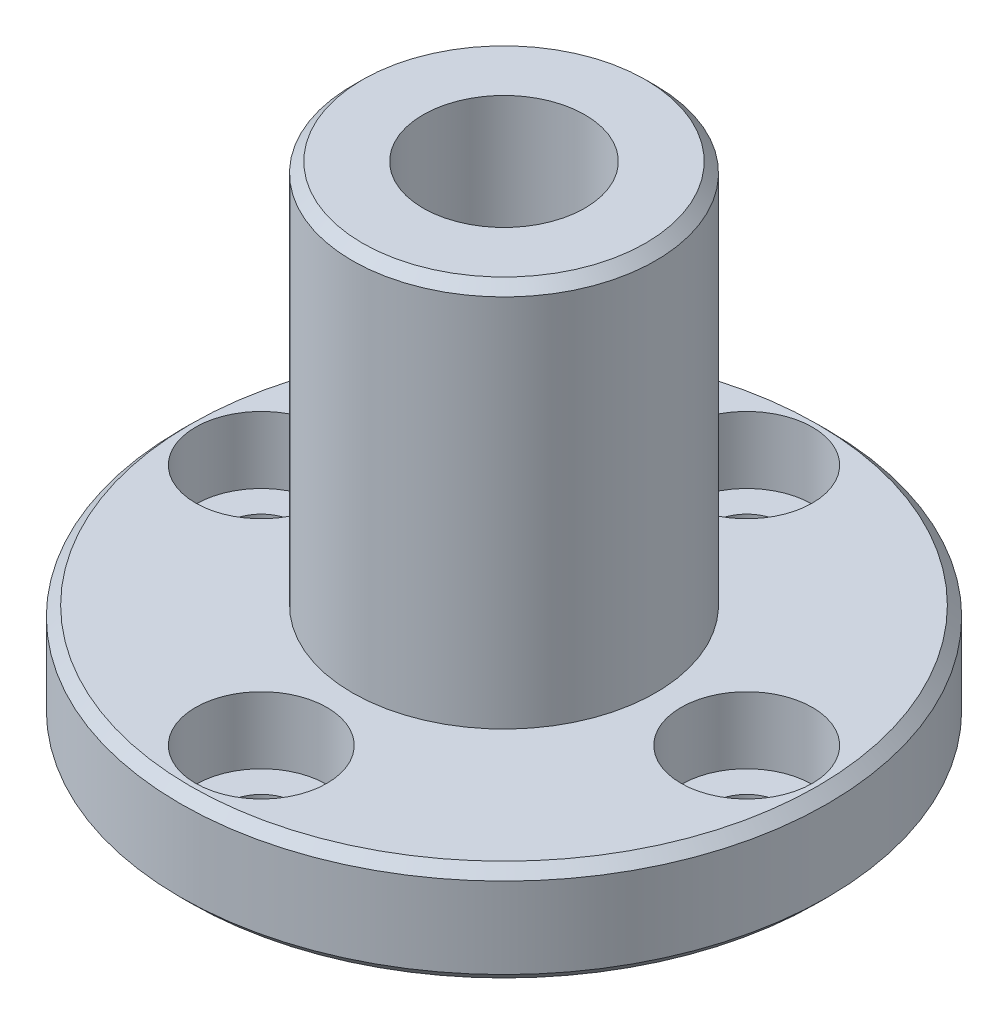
ISO-10303-21;
HEADER;
FILE_DESCRIPTION(('STEP AP214'),'2;1');
FILE_NAME('part.step','',(''),(''),'','','');
FILE_SCHEMA(('AUTOMOTIVE_DESIGN { 1 0 10303 214 1 1 1 1 }'));
ENDSEC;
DATA;
#1=APPLICATION_CONTEXT('core data for automotive mechanical design processes');
#2=APPLICATION_PROTOCOL_DEFINITION('international standard','automotive_design',2000,#1);
#3=PRODUCT_CONTEXT('',#1,'mechanical');
#4=PRODUCT('Part','Part','',(#3));
#5=PRODUCT_RELATED_PRODUCT_CATEGORY('part','',(#4));
#6=PRODUCT_DEFINITION_FORMATION('','',#4);
#7=PRODUCT_DEFINITION_CONTEXT('part definition',#1,'design');
#8=PRODUCT_DEFINITION('design','',#6,#7);
#9=PRODUCT_DEFINITION_SHAPE('','',#8);
#10=(LENGTH_UNIT() NAMED_UNIT(*) SI_UNIT(.MILLI.,.METRE.));
#11=(NAMED_UNIT(*) PLANE_ANGLE_UNIT() SI_UNIT($,.RADIAN.));
#12=(NAMED_UNIT(*) SI_UNIT($,.STERADIAN.) SOLID_ANGLE_UNIT());
#13=UNCERTAINTY_MEASURE_WITH_UNIT(LENGTH_MEASURE(1.E-05),#10,'distance_accuracy_value','');
#14=(GEOMETRIC_REPRESENTATION_CONTEXT(3) GLOBAL_UNCERTAINTY_ASSIGNED_CONTEXT((#13)) GLOBAL_UNIT_ASSIGNED_CONTEXT((#10,
#11,#12)) REPRESENTATION_CONTEXT('',''));
#15=CARTESIAN_POINT('',(0.,0.,0.));
#16=DIRECTION('',(0.,0.,1.));
#17=DIRECTION('',(1.,0.,0.));
#18=AXIS2_PLACEMENT_3D('',#15,#16,#17);
#19=CARTESIAN_POINT('',(0.,0.,0.));
#20=DIRECTION('',(0.,1.,0.));
#21=DIRECTION('',(0.,0.,1.));
#22=AXIS2_PLACEMENT_3D('',#19,#20,#21);
#23=CONICAL_SURFACE('',#22,15.5,0.785398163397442);
#24=CARTESIAN_POINT('',(0.,0.500000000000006,0.));
#25=DIRECTION('',(0.,1.,0.));
#26=DIRECTION('',(0.,0.,1.));
#27=AXIS2_PLACEMENT_3D('',#24,#25,#26);
#28=CIRCLE('',#27,16.);
#29=CARTESIAN_POINT('',(0.,0.500000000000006,16.));
#30=VERTEX_POINT('',#29);
#31=CARTESIAN_POINT('',(0.,0.500000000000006,-16.));
#32=VERTEX_POINT('',#31);
#33=EDGE_CURVE('E333',#30,#32,#28,.T.);
#34=ORIENTED_EDGE('',*,*,#33,.F.);
#35=CARTESIAN_POINT('',(0.,0.500000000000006,0.));
#36=DIRECTION('',(0.,1.,0.));
#37=DIRECTION('',(0.,0.,1.));
#38=AXIS2_PLACEMENT_3D('',#35,#36,#37);
#39=CIRCLE('',#38,16.);
#40=EDGE_CURVE('E336',#32,#30,#39,.T.);
#41=ORIENTED_EDGE('',*,*,#40,.F.);
#42=DIRECTION('',(0.,-0.707106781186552,0.707106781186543));
#43=VECTOR('',#42,1.);
#44=CARTESIAN_POINT('',(0.,0.,-15.5));
#45=LINE('',#44,#43);
#46=CARTESIAN_POINT('',(0.,0.,-15.5));
#47=VERTEX_POINT('',#46);
#48=EDGE_CURVE('E10',#32,#47,#45,.T.);
#49=ORIENTED_EDGE('',*,*,#48,.T.);
#50=CARTESIAN_POINT('',(0.,0.,0.));
#51=DIRECTION('',(0.,-1.,0.));
#52=DIRECTION('',(0.,0.,1.));
#53=AXIS2_PLACEMENT_3D('',#50,#51,#52);
#54=CIRCLE('',#53,15.5);
#55=CARTESIAN_POINT('',(0.,0.,15.5));
#56=VERTEX_POINT('',#55);
#57=EDGE_CURVE('E320',#56,#47,#54,.T.);
#58=ORIENTED_EDGE('',*,*,#57,.F.);
#59=CARTESIAN_POINT('',(0.,0.,0.));
#60=DIRECTION('',(0.,-1.,0.));
#61=DIRECTION('',(0.,0.,1.));
#62=AXIS2_PLACEMENT_3D('',#59,#60,#61);
#63=CIRCLE('',#62,15.5);
#64=EDGE_CURVE('E316',#47,#56,#63,.T.);
#65=ORIENTED_EDGE('',*,*,#64,.F.);
#66=ORIENTED_EDGE('',*,*,#48,.F.);
#67=EDGE_LOOP('',(#34,#41,#49,#58,#65,#66));
#68=FACE_BOUND('',#67,.T.);
#69=ADVANCED_FACE('F16',(#68),#23,.T.);
#70=CARTESIAN_POINT('',(0.,4.5,0.));
#71=DIRECTION('',(0.,-1.,0.));
#72=DIRECTION('',(0.,0.,-1.));
#73=AXIS2_PLACEMENT_3D('',#70,#71,#72);
#74=CONICAL_SURFACE('',#73,16.,0.785398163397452);
#75=CARTESIAN_POINT('',(0.,4.5,0.));
#76=DIRECTION('',(0.,-1.,0.));
#77=DIRECTION('',(0.,0.,-1.));
#78=AXIS2_PLACEMENT_3D('',#75,#76,#77);
#79=CIRCLE('',#78,16.);
#80=CARTESIAN_POINT('',(0.,4.5,-16.));
#81=VERTEX_POINT('',#80);
#82=CARTESIAN_POINT('',(0.,4.5,16.));
#83=VERTEX_POINT('',#82);
#84=EDGE_CURVE('E308',#81,#83,#79,.T.);
#85=ORIENTED_EDGE('',*,*,#84,.F.);
#86=CARTESIAN_POINT('',(0.,4.5,0.));
#87=DIRECTION('',(0.,-1.,0.));
#88=DIRECTION('',(0.,0.,-1.));
#89=AXIS2_PLACEMENT_3D('',#86,#87,#88);
#90=CIRCLE('',#89,16.);
#91=EDGE_CURVE('E358',#83,#81,#90,.T.);
#92=ORIENTED_EDGE('',*,*,#91,.F.);
#93=DIRECTION('',(0.,0.707106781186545,-0.70710678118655));
#94=VECTOR('',#93,1.);
#95=CARTESIAN_POINT('',(0.,4.5,16.));
#96=LINE('',#95,#94);
#97=CARTESIAN_POINT('',(0.,5.,15.5));
#98=VERTEX_POINT('',#97);
#99=EDGE_CURVE('E19',#83,#98,#96,.T.);
#100=ORIENTED_EDGE('',*,*,#99,.T.);
#101=CARTESIAN_POINT('',(0.,5.,0.));
#102=DIRECTION('',(0.,1.,0.));
#103=DIRECTION('',(0.,0.,-1.));
#104=AXIS2_PLACEMENT_3D('',#101,#102,#103);
#105=CIRCLE('',#104,15.5);
#106=CARTESIAN_POINT('',(0.,5.,-15.5));
#107=VERTEX_POINT('',#106);
#108=EDGE_CURVE('E298',#107,#98,#105,.T.);
#109=ORIENTED_EDGE('',*,*,#108,.F.);
#110=CARTESIAN_POINT('',(0.,5.,0.));
#111=DIRECTION('',(0.,1.,0.));
#112=DIRECTION('',(0.,0.,-1.));
#113=AXIS2_PLACEMENT_3D('',#110,#111,#112);
#114=CIRCLE('',#113,15.5);
#115=EDGE_CURVE('E293',#98,#107,#114,.T.);
#116=ORIENTED_EDGE('',*,*,#115,.F.);
#117=ORIENTED_EDGE('',*,*,#99,.F.);
#118=EDGE_LOOP('',(#85,#92,#100,#109,#116,#117));
#119=FACE_BOUND('',#118,.T.);
#120=ADVANCED_FACE('F496',(#119),#74,.T.);
#121=CARTESIAN_POINT('',(0.,23.5,0.));
#122=DIRECTION('',(0.,-1.,0.));
#123=DIRECTION('',(0.,0.,-1.));
#124=AXIS2_PLACEMENT_3D('',#121,#122,#123);
#125=CONICAL_SURFACE('',#124,7.5,0.785398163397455);
#126=CARTESIAN_POINT('',(0.,23.5,0.));
#127=DIRECTION('',(0.,-1.,0.));
#128=DIRECTION('',(0.,0.,-1.));
#129=AXIS2_PLACEMENT_3D('',#126,#127,#128);
#130=CIRCLE('',#129,7.5);
#131=CARTESIAN_POINT('',(0.,23.5,-7.5));
#132=VERTEX_POINT('',#131);
#133=CARTESIAN_POINT('',(0.,23.5,7.5));
#134=VERTEX_POINT('',#133);
#135=EDGE_CURVE('E202',#132,#134,#130,.T.);
#136=ORIENTED_EDGE('',*,*,#135,.F.);
#137=CARTESIAN_POINT('',(0.,23.5,0.));
#138=DIRECTION('',(0.,-1.,0.));
#139=DIRECTION('',(0.,0.,-1.));
#140=AXIS2_PLACEMENT_3D('',#137,#138,#139);
#141=CIRCLE('',#140,7.5);
#142=EDGE_CURVE('E206',#134,#132,#141,.T.);
#143=ORIENTED_EDGE('',*,*,#142,.F.);
#144=DIRECTION('',(0.,0.707106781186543,-0.707106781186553));
#145=VECTOR('',#144,1.);
#146=CARTESIAN_POINT('',(0.,23.5,7.5));
#147=LINE('',#146,#145);
#148=CARTESIAN_POINT('',(0.,24.,7.));
#149=VERTEX_POINT('',#148);
#150=EDGE_CURVE('E269',#134,#149,#147,.T.);
#151=ORIENTED_EDGE('',*,*,#150,.T.);
#152=CARTESIAN_POINT('',(0.,24.,0.));
#153=DIRECTION('',(0.,1.,0.));
#154=DIRECTION('',(0.,0.,-1.));
#155=AXIS2_PLACEMENT_3D('',#152,#153,#154);
#156=CIRCLE('',#155,7.);
#157=CARTESIAN_POINT('',(0.,24.,-7.));
#158=VERTEX_POINT('',#157);
#159=EDGE_CURVE('E197',#158,#149,#156,.T.);
#160=ORIENTED_EDGE('',*,*,#159,.F.);
#161=CARTESIAN_POINT('',(0.,24.,0.));
#162=DIRECTION('',(0.,1.,0.));
#163=DIRECTION('',(0.,0.,-1.));
#164=AXIS2_PLACEMENT_3D('',#161,#162,#163);
#165=CIRCLE('',#164,7.);
#166=EDGE_CURVE('E201',#149,#158,#165,.T.);
#167=ORIENTED_EDGE('',*,*,#166,.F.);
#168=ORIENTED_EDGE('',*,*,#150,.F.);
#169=EDGE_LOOP('',(#136,#143,#151,#160,#167,#168));
#170=FACE_BOUND('',#169,.T.);
#171=ADVANCED_FACE('F715',(#170),#125,.T.);
#172=CARTESIAN_POINT('',(0.,5.,-12.));
#173=DIRECTION('',(0.,1.,0.));
#174=DIRECTION('',(0.,0.,1.));
#175=AXIS2_PLACEMENT_3D('',#172,#173,#174);
#176=CYLINDRICAL_SURFACE('',#175,3.25);
#177=CARTESIAN_POINT('',(0.,1.7,-12.));
#178=DIRECTION('',(0.,1.,0.));
#179=DIRECTION('',(0.,0.,1.));
#180=AXIS2_PLACEMENT_3D('',#177,#178,#179);
#181=CIRCLE('',#180,3.25);
#182=CARTESIAN_POINT('',(0.,1.7,-8.75));
#183=VERTEX_POINT('',#182);
#184=CARTESIAN_POINT('',(0.,1.7,-15.25));
#185=VERTEX_POINT('',#184);
#186=EDGE_CURVE('E140',#183,#185,#181,.T.);
#187=ORIENTED_EDGE('',*,*,#186,.F.);
#188=CARTESIAN_POINT('',(0.,1.7,-12.));
#189=DIRECTION('',(0.,1.,0.));
#190=DIRECTION('',(0.,0.,1.));
#191=AXIS2_PLACEMENT_3D('',#188,#189,#190);
#192=CIRCLE('',#191,3.25);
#193=EDGE_CURVE('E48',#185,#183,#192,.T.);
#194=ORIENTED_EDGE('',*,*,#193,.F.);
#195=DIRECTION('',(0.,1.,0.));
#196=VECTOR('',#195,1.);
#197=CARTESIAN_POINT('',(0.,5.,-15.25));
#198=LINE('',#197,#196);
#199=CARTESIAN_POINT('',(0.,5.,-15.25));
#200=VERTEX_POINT('',#199);
#201=EDGE_CURVE('E37',#185,#200,#198,.T.);
#202=ORIENTED_EDGE('',*,*,#201,.T.);
#203=CARTESIAN_POINT('',(0.,5.,-12.));
#204=DIRECTION('',(0.,1.,0.));
#205=DIRECTION('',(0.,0.,1.));
#206=AXIS2_PLACEMENT_3D('',#203,#204,#205);
#207=CIRCLE('',#206,3.25);
#208=CARTESIAN_POINT('',(0.,5.,-8.75));
#209=VERTEX_POINT('',#208);
#210=EDGE_CURVE('E284',#200,#209,#207,.T.);
#211=ORIENTED_EDGE('',*,*,#210,.T.);
#212=CARTESIAN_POINT('',(0.,5.,-12.));
#213=DIRECTION('',(0.,1.,0.));
#214=DIRECTION('',(0.,0.,1.));
#215=AXIS2_PLACEMENT_3D('',#212,#213,#214);
#216=CIRCLE('',#215,3.25);
#217=EDGE_CURVE('E282',#209,#200,#216,.T.);
#218=ORIENTED_EDGE('',*,*,#217,.T.);
#219=ORIENTED_EDGE('',*,*,#201,.F.);
#220=EDGE_LOOP('',(#187,#194,#202,#211,#218,#219));
#221=FACE_BOUND('',#220,.T.);
#222=ADVANCED_FACE('F725',(#221),#176,.F.);
#223=CARTESIAN_POINT('',(1.7,1.7,-12.));
#224=DIRECTION('',(0.,-1.,0.));
#225=DIRECTION('',(0.,0.,-1.));
#226=AXIS2_PLACEMENT_3D('',#223,#224,#225);
#227=PLANE('',#226);
#228=CARTESIAN_POINT('',(0.,1.7,-12.));
#229=DIRECTION('',(0.,1.,0.));
#230=DIRECTION('',(0.,0.,1.));
#231=AXIS2_PLACEMENT_3D('',#228,#229,#230);
#232=CIRCLE('',#231,1.7);
#233=CARTESIAN_POINT('',(0.,1.7,-10.3));
#234=VERTEX_POINT('',#233);
#235=CARTESIAN_POINT('',(0.,1.7,-13.7));
#236=VERTEX_POINT('',#235);
#237=EDGE_CURVE('E129',#234,#236,#232,.T.);
#238=ORIENTED_EDGE('',*,*,#237,.F.);
#239=CARTESIAN_POINT('',(0.,1.7,-12.));
#240=DIRECTION('',(0.,1.,0.));
#241=DIRECTION('',(0.,0.,1.));
#242=AXIS2_PLACEMENT_3D('',#239,#240,#241);
#243=CIRCLE('',#242,1.7);
#244=EDGE_CURVE('E137',#236,#234,#243,.T.);
#245=ORIENTED_EDGE('',*,*,#244,.F.);
#246=EDGE_LOOP('',(#238,#245));
#247=FACE_BOUND('',#246,.T.);
#248=ORIENTED_EDGE('',*,*,#186,.T.);
#249=ORIENTED_EDGE('',*,*,#193,.T.);
#250=EDGE_LOOP('',(#248,#249));
#251=FACE_BOUND('',#250,.T.);
#252=ADVANCED_FACE('F142',(#247,#251),#227,.F.);
#253=CARTESIAN_POINT('',(0.,5.,-12.));
#254=DIRECTION('',(0.,1.,0.));
#255=DIRECTION('',(0.,0.,1.));
#256=AXIS2_PLACEMENT_3D('',#253,#254,#255);
#257=CYLINDRICAL_SURFACE('',#256,1.7);
#258=CARTESIAN_POINT('',(0.,0.,-12.));
#259=DIRECTION('',(0.,1.,0.));
#260=DIRECTION('',(0.,0.,1.));
#261=AXIS2_PLACEMENT_3D('',#258,#259,#260);
#262=CIRCLE('',#261,1.7);
#263=CARTESIAN_POINT('',(0.,0.,-10.3));
#264=VERTEX_POINT('',#263);
#265=CARTESIAN_POINT('',(0.,0.,-13.7));
#266=VERTEX_POINT('',#265);
#267=EDGE_CURVE('E315',#264,#266,#262,.T.);
#268=ORIENTED_EDGE('',*,*,#267,.F.);
#269=CARTESIAN_POINT('',(0.,0.,-12.));
#270=DIRECTION('',(0.,1.,0.));
#271=DIRECTION('',(0.,0.,1.));
#272=AXIS2_PLACEMENT_3D('',#269,#270,#271);
#273=CIRCLE('',#272,1.7);
#274=EDGE_CURVE('E146',#266,#264,#273,.T.);
#275=ORIENTED_EDGE('',*,*,#274,.F.);
#276=DIRECTION('',(0.,1.,0.));
#277=VECTOR('',#276,1.);
#278=CARTESIAN_POINT('',(0.,5.,-13.7));
#279=LINE('',#278,#277);
#280=EDGE_CURVE('E135',#266,#236,#279,.T.);
#281=ORIENTED_EDGE('',*,*,#280,.T.);
#282=ORIENTED_EDGE('',*,*,#244,.T.);
#283=ORIENTED_EDGE('',*,*,#237,.T.);
#284=ORIENTED_EDGE('',*,*,#280,.F.);
#285=EDGE_LOOP('',(#268,#275,#281,#282,#283,#284));
#286=FACE_BOUND('',#285,.T.);
#287=ADVANCED_FACE('F132',(#286),#257,.F.);
#288=CARTESIAN_POINT('',(12.,5.,0.));
#289=DIRECTION('',(0.,1.,0.));
#290=DIRECTION('',(0.,0.,1.));
#291=AXIS2_PLACEMENT_3D('',#288,#289,#290);
#292=CYLINDRICAL_SURFACE('',#291,3.25);
#293=CARTESIAN_POINT('',(12.,1.7,0.));
#294=DIRECTION('',(0.,1.,0.));
#295=DIRECTION('',(0.,0.,1.));
#296=AXIS2_PLACEMENT_3D('',#293,#294,#295);
#297=CIRCLE('',#296,3.25);
#298=CARTESIAN_POINT('',(12.,1.7,3.25));
#299=VERTEX_POINT('',#298);
#300=CARTESIAN_POINT('',(12.,1.7,-3.25));
#301=VERTEX_POINT('',#300);
#302=EDGE_CURVE('E261',#299,#301,#297,.T.);
#303=ORIENTED_EDGE('',*,*,#302,.F.);
#304=CARTESIAN_POINT('',(12.,1.7,0.));
#305=DIRECTION('',(0.,1.,0.));
#306=DIRECTION('',(0.,0.,1.));
#307=AXIS2_PLACEMENT_3D('',#304,#305,#306);
#308=CIRCLE('',#307,3.25);
#309=EDGE_CURVE('E156',#301,#299,#308,.T.);
#310=ORIENTED_EDGE('',*,*,#309,.F.);
#311=DIRECTION('',(0.,1.,0.));
#312=VECTOR('',#311,1.);
#313=CARTESIAN_POINT('',(12.,5.,-3.25));
#314=LINE('',#313,#312);
#315=CARTESIAN_POINT('',(12.,5.,-3.25));
#316=VERTEX_POINT('',#315);
#317=EDGE_CURVE('E149',#301,#316,#314,.T.);
#318=ORIENTED_EDGE('',*,*,#317,.T.);
#319=CARTESIAN_POINT('',(12.,5.,0.));
#320=DIRECTION('',(0.,1.,0.));
#321=DIRECTION('',(0.,0.,1.));
#322=AXIS2_PLACEMENT_3D('',#319,#320,#321);
#323=CIRCLE('',#322,3.25);
#324=CARTESIAN_POINT('',(12.,5.,3.25));
#325=VERTEX_POINT('',#324);
#326=EDGE_CURVE('E162',#316,#325,#323,.T.);
#327=ORIENTED_EDGE('',*,*,#326,.T.);
#328=CARTESIAN_POINT('',(12.,5.,0.));
#329=DIRECTION('',(0.,1.,0.));
#330=DIRECTION('',(0.,0.,1.));
#331=AXIS2_PLACEMENT_3D('',#328,#329,#330);
#332=CIRCLE('',#331,3.25);
#333=EDGE_CURVE('E160',#325,#316,#332,.T.);
#334=ORIENTED_EDGE('',*,*,#333,.T.);
#335=ORIENTED_EDGE('',*,*,#317,.F.);
#336=EDGE_LOOP('',(#303,#310,#318,#327,#334,#335));
#337=FACE_BOUND('',#336,.T.);
#338=ADVANCED_FACE('F486',(#337),#292,.F.);
#339=CARTESIAN_POINT('',(13.7,1.7,0.));
#340=DIRECTION('',(0.,-1.,0.));
#341=DIRECTION('',(0.,0.,-1.));
#342=AXIS2_PLACEMENT_3D('',#339,#340,#341);
#343=PLANE('',#342);
#344=CARTESIAN_POINT('',(12.,1.7,0.));
#345=DIRECTION('',(0.,1.,0.));
#346=DIRECTION('',(0.,0.,1.));
#347=AXIS2_PLACEMENT_3D('',#344,#345,#346);
#348=CIRCLE('',#347,1.7);
#349=CARTESIAN_POINT('',(12.,1.7,1.7));
#350=VERTEX_POINT('',#349);
#351=CARTESIAN_POINT('',(12.,1.7,-1.7));
#352=VERTEX_POINT('',#351);
#353=EDGE_CURVE('E258',#350,#352,#348,.T.);
#354=ORIENTED_EDGE('',*,*,#353,.F.);
#355=CARTESIAN_POINT('',(12.,1.7,0.));
#356=DIRECTION('',(0.,1.,0.));
#357=DIRECTION('',(0.,0.,1.));
#358=AXIS2_PLACEMENT_3D('',#355,#356,#357);
#359=CIRCLE('',#358,1.7);
#360=EDGE_CURVE('E254',#352,#350,#359,.T.);
#361=ORIENTED_EDGE('',*,*,#360,.F.);
#362=EDGE_LOOP('',(#354,#361));
#363=FACE_BOUND('',#362,.T.);
#364=ORIENTED_EDGE('',*,*,#302,.T.);
#365=ORIENTED_EDGE('',*,*,#309,.T.);
#366=EDGE_LOOP('',(#364,#365));
#367=FACE_BOUND('',#366,.T.);
#368=ADVANCED_FACE('F758',(#363,#367),#343,.F.);
#369=CARTESIAN_POINT('',(12.,5.,0.));
#370=DIRECTION('',(0.,1.,0.));
#371=DIRECTION('',(0.,0.,1.));
#372=AXIS2_PLACEMENT_3D('',#369,#370,#371);
#373=CYLINDRICAL_SURFACE('',#372,1.7);
#374=CARTESIAN_POINT('',(12.,0.,0.));
#375=DIRECTION('',(0.,1.,0.));
#376=DIRECTION('',(0.,0.,1.));
#377=AXIS2_PLACEMENT_3D('',#374,#375,#376);
#378=CIRCLE('',#377,1.7);
#379=CARTESIAN_POINT('',(12.,0.,1.7));
#380=VERTEX_POINT('',#379);
#381=CARTESIAN_POINT('',(12.,0.,-1.7));
#382=VERTEX_POINT('',#381);
#383=EDGE_CURVE('E314',#380,#382,#378,.T.);
#384=ORIENTED_EDGE('',*,*,#383,.F.);
#385=CARTESIAN_POINT('',(12.,0.,0.));
#386=DIRECTION('',(0.,1.,0.));
#387=DIRECTION('',(0.,0.,1.));
#388=AXIS2_PLACEMENT_3D('',#385,#386,#387);
#389=CIRCLE('',#388,1.7);
#390=EDGE_CURVE('E332',#382,#380,#389,.T.);
#391=ORIENTED_EDGE('',*,*,#390,.F.);
#392=DIRECTION('',(0.,1.,0.));
#393=VECTOR('',#392,1.);
#394=CARTESIAN_POINT('',(12.,5.,-1.7));
#395=LINE('',#394,#393);
#396=EDGE_CURVE('E250',#382,#352,#395,.T.);
#397=ORIENTED_EDGE('',*,*,#396,.T.);
#398=ORIENTED_EDGE('',*,*,#360,.T.);
#399=ORIENTED_EDGE('',*,*,#353,.T.);
#400=ORIENTED_EDGE('',*,*,#396,.F.);
#401=EDGE_LOOP('',(#384,#391,#397,#398,#399,#400));
#402=FACE_BOUND('',#401,.T.);
#403=ADVANCED_FACE('F769',(#402),#373,.F.);
#404=CARTESIAN_POINT('',(0.,5.,12.));
#405=DIRECTION('',(0.,1.,0.));
#406=DIRECTION('',(0.,0.,1.));
#407=AXIS2_PLACEMENT_3D('',#404,#405,#406);
#408=CYLINDRICAL_SURFACE('',#407,3.25);
#409=CARTESIAN_POINT('',(0.,1.7,12.));
#410=DIRECTION('',(0.,1.,0.));
#411=DIRECTION('',(0.,0.,1.));
#412=AXIS2_PLACEMENT_3D('',#409,#410,#411);
#413=CIRCLE('',#412,3.25);
#414=CARTESIAN_POINT('',(0.,1.7,15.25));
#415=VERTEX_POINT('',#414);
#416=CARTESIAN_POINT('',(0.,1.7,8.75));
#417=VERTEX_POINT('',#416);
#418=EDGE_CURVE('E242',#415,#417,#413,.T.);
#419=ORIENTED_EDGE('',*,*,#418,.F.);
#420=CARTESIAN_POINT('',(0.,1.7,12.));
#421=DIRECTION('',(0.,1.,0.));
#422=DIRECTION('',(0.,0.,1.));
#423=AXIS2_PLACEMENT_3D('',#420,#421,#422);
#424=CIRCLE('',#423,3.25);
#425=EDGE_CURVE('E246',#417,#415,#424,.T.);
#426=ORIENTED_EDGE('',*,*,#425,.F.);
#427=DIRECTION('',(0.,1.,0.));
#428=VECTOR('',#427,1.);
#429=CARTESIAN_POINT('',(0.,5.,8.75));
#430=LINE('',#429,#428);
#431=CARTESIAN_POINT('',(0.,5.,8.75));
#432=VERTEX_POINT('',#431);
#433=EDGE_CURVE('E249',#417,#432,#430,.T.);
#434=ORIENTED_EDGE('',*,*,#433,.T.);
#435=CARTESIAN_POINT('',(0.,5.,12.));
#436=DIRECTION('',(0.,1.,0.));
#437=DIRECTION('',(0.,0.,1.));
#438=AXIS2_PLACEMENT_3D('',#435,#436,#437);
#439=CIRCLE('',#438,3.25);
#440=CARTESIAN_POINT('',(0.,5.,15.25));
#441=VERTEX_POINT('',#440);
#442=EDGE_CURVE('E176',#432,#441,#439,.T.);
#443=ORIENTED_EDGE('',*,*,#442,.T.);
#444=CARTESIAN_POINT('',(0.,5.,12.));
#445=DIRECTION('',(0.,1.,0.));
#446=DIRECTION('',(0.,0.,1.));
#447=AXIS2_PLACEMENT_3D('',#444,#445,#446);
#448=CIRCLE('',#447,3.25);
#449=EDGE_CURVE('E166',#441,#432,#448,.T.);
#450=ORIENTED_EDGE('',*,*,#449,.T.);
#451=ORIENTED_EDGE('',*,*,#433,.F.);
#452=EDGE_LOOP('',(#419,#426,#434,#443,#450,#451));
#453=FACE_BOUND('',#452,.T.);
#454=ADVANCED_FACE('F383',(#453),#408,.F.);
#455=CARTESIAN_POINT('',(1.7,1.7,12.));
#456=DIRECTION('',(0.,-1.,0.));
#457=DIRECTION('',(0.,0.,-1.));
#458=AXIS2_PLACEMENT_3D('',#455,#456,#457);
#459=PLANE('',#458);
#460=CARTESIAN_POINT('',(0.,1.7,12.));
#461=DIRECTION('',(0.,1.,0.));
#462=DIRECTION('',(0.,0.,1.));
#463=AXIS2_PLACEMENT_3D('',#460,#461,#462);
#464=CIRCLE('',#463,1.7);
#465=CARTESIAN_POINT('',(0.,1.7,13.7));
#466=VERTEX_POINT('',#465);
#467=CARTESIAN_POINT('',(0.,1.7,10.3));
#468=VERTEX_POINT('',#467);
#469=EDGE_CURVE('E239',#466,#468,#464,.T.);
#470=ORIENTED_EDGE('',*,*,#469,.F.);
#471=CARTESIAN_POINT('',(0.,1.7,12.));
#472=DIRECTION('',(0.,1.,0.));
#473=DIRECTION('',(0.,0.,1.));
#474=AXIS2_PLACEMENT_3D('',#471,#472,#473);
#475=CIRCLE('',#474,1.7);
#476=EDGE_CURVE('E238',#468,#466,#475,.T.);
#477=ORIENTED_EDGE('',*,*,#476,.F.);
#478=EDGE_LOOP('',(#470,#477));
#479=FACE_BOUND('',#478,.T.);
#480=ORIENTED_EDGE('',*,*,#418,.T.);
#481=ORIENTED_EDGE('',*,*,#425,.T.);
#482=EDGE_LOOP('',(#480,#481));
#483=FACE_BOUND('',#482,.T.);
#484=ADVANCED_FACE('F778',(#479,#483),#459,.F.);
#485=CARTESIAN_POINT('',(0.,5.,12.));
#486=DIRECTION('',(0.,1.,0.));
#487=DIRECTION('',(0.,0.,1.));
#488=AXIS2_PLACEMENT_3D('',#485,#486,#487);
#489=CYLINDRICAL_SURFACE('',#488,1.7);
#490=CARTESIAN_POINT('',(0.,0.,12.));
#491=DIRECTION('',(0.,1.,0.));
#492=DIRECTION('',(0.,0.,1.));
#493=AXIS2_PLACEMENT_3D('',#490,#491,#492);
#494=CIRCLE('',#493,1.7);
#495=CARTESIAN_POINT('',(0.,0.,13.7));
#496=VERTEX_POINT('',#495);
#497=CARTESIAN_POINT('',(0.,0.,10.3));
#498=VERTEX_POINT('',#497);
#499=EDGE_CURVE('E345',#496,#498,#494,.T.);
#500=ORIENTED_EDGE('',*,*,#499,.F.);
#501=CARTESIAN_POINT('',(0.,0.,12.));
#502=DIRECTION('',(0.,1.,0.));
#503=DIRECTION('',(0.,0.,1.));
#504=AXIS2_PLACEMENT_3D('',#501,#502,#503);
#505=CIRCLE('',#504,1.7);
#506=EDGE_CURVE('E352',#498,#496,#505,.T.);
#507=ORIENTED_EDGE('',*,*,#506,.F.);
#508=DIRECTION('',(0.,1.,0.));
#509=VECTOR('',#508,1.);
#510=CARTESIAN_POINT('',(0.,5.,10.3));
#511=LINE('',#510,#509);
#512=EDGE_CURVE('E171',#498,#468,#511,.T.);
#513=ORIENTED_EDGE('',*,*,#512,.T.);
#514=ORIENTED_EDGE('',*,*,#476,.T.);
#515=ORIENTED_EDGE('',*,*,#469,.T.);
#516=ORIENTED_EDGE('',*,*,#512,.F.);
#517=EDGE_LOOP('',(#500,#507,#513,#514,#515,#516));
#518=FACE_BOUND('',#517,.T.);
#519=ADVANCED_FACE('F783',(#518),#489,.F.);
#520=CARTESIAN_POINT('',(-12.,5.,0.));
#521=DIRECTION('',(0.,1.,0.));
#522=DIRECTION('',(0.,0.,1.));
#523=AXIS2_PLACEMENT_3D('',#520,#521,#522);
#524=CYLINDRICAL_SURFACE('',#523,3.25);
#525=CARTESIAN_POINT('',(-12.,1.7,0.));
#526=DIRECTION('',(0.,1.,0.));
#527=DIRECTION('',(0.,0.,1.));
#528=AXIS2_PLACEMENT_3D('',#525,#526,#527);
#529=CIRCLE('',#528,3.25);
#530=CARTESIAN_POINT('',(-12.,1.7,3.25));
#531=VERTEX_POINT('',#530);
#532=CARTESIAN_POINT('',(-12.,1.7,-3.25));
#533=VERTEX_POINT('',#532);
#534=EDGE_CURVE('E192',#531,#533,#529,.T.);
#535=ORIENTED_EDGE('',*,*,#534,.F.);
#536=CARTESIAN_POINT('',(-12.,1.7,0.));
#537=DIRECTION('',(0.,1.,0.));
#538=DIRECTION('',(0.,0.,1.));
#539=AXIS2_PLACEMENT_3D('',#536,#537,#538);
#540=CIRCLE('',#539,3.25);
#541=EDGE_CURVE('E172',#533,#531,#540,.T.);
#542=ORIENTED_EDGE('',*,*,#541,.F.);
#543=DIRECTION('',(0.,1.,0.));
#544=VECTOR('',#543,1.);
#545=CARTESIAN_POINT('',(-12.,5.,-3.25));
#546=LINE('',#545,#544);
#547=CARTESIAN_POINT('',(-12.,5.,-3.25));
#548=VERTEX_POINT('',#547);
#549=EDGE_CURVE('E167',#533,#548,#546,.T.);
#550=ORIENTED_EDGE('',*,*,#549,.T.);
#551=CARTESIAN_POINT('',(-12.,5.,0.));
#552=DIRECTION('',(0.,1.,0.));
#553=DIRECTION('',(0.,0.,1.));
#554=AXIS2_PLACEMENT_3D('',#551,#552,#553);
#555=CIRCLE('',#554,3.25);
#556=CARTESIAN_POINT('',(-12.,5.,3.25));
#557=VERTEX_POINT('',#556);
#558=EDGE_CURVE('E181',#548,#557,#555,.T.);
#559=ORIENTED_EDGE('',*,*,#558,.T.);
#560=CARTESIAN_POINT('',(-12.,5.,0.));
#561=DIRECTION('',(0.,1.,0.));
#562=DIRECTION('',(0.,0.,1.));
#563=AXIS2_PLACEMENT_3D('',#560,#561,#562);
#564=CIRCLE('',#563,3.25);
#565=EDGE_CURVE('E177',#557,#548,#564,.T.);
#566=ORIENTED_EDGE('',*,*,#565,.T.);
#567=ORIENTED_EDGE('',*,*,#549,.F.);
#568=EDGE_LOOP('',(#535,#542,#550,#559,#566,#567));
#569=FACE_BOUND('',#568,.T.);
#570=ADVANCED_FACE('F814',(#569),#524,.F.);
#571=CARTESIAN_POINT('',(-10.3,1.7,0.));
#572=DIRECTION('',(0.,-1.,0.));
#573=DIRECTION('',(0.,0.,-1.));
#574=AXIS2_PLACEMENT_3D('',#571,#572,#573);
#575=PLANE('',#574);
#576=CARTESIAN_POINT('',(-12.,1.7,0.));
#577=DIRECTION('',(0.,1.,0.));
#578=DIRECTION('',(0.,0.,1.));
#579=AXIS2_PLACEMENT_3D('',#576,#577,#578);
#580=CIRCLE('',#579,1.7);
#581=CARTESIAN_POINT('',(-12.,1.7,1.7));
#582=VERTEX_POINT('',#581);
#583=CARTESIAN_POINT('',(-12.,1.7,-1.7));
#584=VERTEX_POINT('',#583);
#585=EDGE_CURVE('E229',#582,#584,#580,.T.);
#586=ORIENTED_EDGE('',*,*,#585,.F.);
#587=CARTESIAN_POINT('',(-12.,1.7,0.));
#588=DIRECTION('',(0.,1.,0.));
#589=DIRECTION('',(0.,0.,1.));
#590=AXIS2_PLACEMENT_3D('',#587,#588,#589);
#591=CIRCLE('',#590,1.7);
#592=EDGE_CURVE('E225',#584,#582,#591,.T.);
#593=ORIENTED_EDGE('',*,*,#592,.F.);
#594=EDGE_LOOP('',(#586,#593));
#595=FACE_BOUND('',#594,.T.);
#596=ORIENTED_EDGE('',*,*,#534,.T.);
#597=ORIENTED_EDGE('',*,*,#541,.T.);
#598=EDGE_LOOP('',(#596,#597));
#599=FACE_BOUND('',#598,.T.);
#600=ADVANCED_FACE('F829',(#595,#599),#575,.F.);
#601=CARTESIAN_POINT('',(-12.,5.,0.));
#602=DIRECTION('',(0.,1.,0.));
#603=DIRECTION('',(0.,0.,1.));
#604=AXIS2_PLACEMENT_3D('',#601,#602,#603);
#605=CYLINDRICAL_SURFACE('',#604,1.7);
#606=CARTESIAN_POINT('',(-12.,0.,0.));
#607=DIRECTION('',(0.,1.,0.));
#608=DIRECTION('',(0.,0.,1.));
#609=AXIS2_PLACEMENT_3D('',#606,#607,#608);
#610=CIRCLE('',#609,1.7);
#611=CARTESIAN_POINT('',(-12.,0.,1.7));
#612=VERTEX_POINT('',#611);
#613=CARTESIAN_POINT('',(-12.,0.,-1.7));
#614=VERTEX_POINT('',#613);
#615=EDGE_CURVE('E328',#612,#614,#610,.T.);
#616=ORIENTED_EDGE('',*,*,#615,.F.);
#617=CARTESIAN_POINT('',(-12.,0.,0.));
#618=DIRECTION('',(0.,1.,0.));
#619=DIRECTION('',(0.,0.,1.));
#620=AXIS2_PLACEMENT_3D('',#617,#618,#619);
#621=CIRCLE('',#620,1.7);
#622=EDGE_CURVE('E323',#614,#612,#621,.T.);
#623=ORIENTED_EDGE('',*,*,#622,.F.);
#624=DIRECTION('',(0.,1.,0.));
#625=VECTOR('',#624,1.);
#626=CARTESIAN_POINT('',(-12.,5.,-1.7));
#627=LINE('',#626,#625);
#628=EDGE_CURVE('E221',#614,#584,#627,.T.);
#629=ORIENTED_EDGE('',*,*,#628,.T.);
#630=ORIENTED_EDGE('',*,*,#592,.T.);
#631=ORIENTED_EDGE('',*,*,#585,.T.);
#632=ORIENTED_EDGE('',*,*,#628,.F.);
#633=EDGE_LOOP('',(#616,#623,#629,#630,#631,#632));
#634=FACE_BOUND('',#633,.T.);
#635=ADVANCED_FACE('F823',(#634),#605,.F.);
#636=CARTESIAN_POINT('',(0.,24.,0.));
#637=DIRECTION('',(0.,-1.,0.));
#638=DIRECTION('',(0.,0.,-1.));
#639=AXIS2_PLACEMENT_3D('',#636,#637,#638);
#640=CYLINDRICAL_SURFACE('',#639,4.);
#641=CARTESIAN_POINT('',(0.,24.,0.));
#642=DIRECTION('',(0.,-1.,0.));
#643=DIRECTION('',(0.,0.,-1.));
#644=AXIS2_PLACEMENT_3D('',#641,#642,#643);
#645=CIRCLE('',#644,4.);
#646=CARTESIAN_POINT('',(0.,24.,-4.));
#647=VERTEX_POINT('',#646);
#648=CARTESIAN_POINT('',(0.,24.,4.));
#649=VERTEX_POINT('',#648);
#650=EDGE_CURVE('E213',#647,#649,#645,.T.);
#651=ORIENTED_EDGE('',*,*,#650,.F.);
#652=CARTESIAN_POINT('',(0.,24.,0.));
#653=DIRECTION('',(0.,-1.,0.));
#654=DIRECTION('',(0.,0.,-1.));
#655=AXIS2_PLACEMENT_3D('',#652,#653,#654);
#656=CIRCLE('',#655,4.);
#657=EDGE_CURVE('E217',#649,#647,#656,.T.);
#658=ORIENTED_EDGE('',*,*,#657,.F.);
#659=DIRECTION('',(0.,-1.,0.));
#660=VECTOR('',#659,1.);
#661=CARTESIAN_POINT('',(0.,24.,4.));
#662=LINE('',#661,#660);
#663=CARTESIAN_POINT('',(0.,0.,4.));
#664=VERTEX_POINT('',#663);
#665=EDGE_CURVE('E220',#649,#664,#662,.T.);
#666=ORIENTED_EDGE('',*,*,#665,.T.);
#667=CARTESIAN_POINT('',(0.,0.,0.));
#668=DIRECTION('',(0.,-1.,0.));
#669=DIRECTION('',(0.,0.,-1.));
#670=AXIS2_PLACEMENT_3D('',#667,#668,#669);
#671=CIRCLE('',#670,4.);
#672=CARTESIAN_POINT('',(0.,0.,-4.));
#673=VERTEX_POINT('',#672);
#674=EDGE_CURVE('E337',#664,#673,#671,.T.);
#675=ORIENTED_EDGE('',*,*,#674,.T.);
#676=CARTESIAN_POINT('',(0.,0.,0.));
#677=DIRECTION('',(0.,-1.,0.));
#678=DIRECTION('',(0.,0.,-1.));
#679=AXIS2_PLACEMENT_3D('',#676,#677,#678);
#680=CIRCLE('',#679,4.);
#681=EDGE_CURVE('E327',#673,#664,#680,.T.);
#682=ORIENTED_EDGE('',*,*,#681,.T.);
#683=ORIENTED_EDGE('',*,*,#665,.F.);
#684=EDGE_LOOP('',(#651,#658,#666,#675,#682,#683));
#685=FACE_BOUND('',#684,.T.);
#686=ADVANCED_FACE('F828',(#685),#640,.F.);
#687=CARTESIAN_POINT('',(-7.5,24.,0.));
#688=DIRECTION('',(0.,-1.,0.));
#689=DIRECTION('',(0.,0.,-1.));
#690=AXIS2_PLACEMENT_3D('',#687,#688,#689);
#691=PLANE('',#690);
#692=ORIENTED_EDGE('',*,*,#650,.T.);
#693=ORIENTED_EDGE('',*,*,#657,.T.);
#694=EDGE_LOOP('',(#692,#693));
#695=FACE_BOUND('',#694,.T.);
#696=ORIENTED_EDGE('',*,*,#159,.T.);
#697=ORIENTED_EDGE('',*,*,#166,.T.);
#698=EDGE_LOOP('',(#696,#697));
#699=FACE_BOUND('',#698,.T.);
#700=ADVANCED_FACE('F852',(#695,#699),#691,.F.);
#701=CARTESIAN_POINT('',(0.,0.,0.));
#702=DIRECTION('',(0.,-1.,0.));
#703=DIRECTION('',(0.,0.,-1.));
#704=AXIS2_PLACEMENT_3D('',#701,#702,#703);
#705=CYLINDRICAL_SURFACE('',#704,7.5);
#706=CARTESIAN_POINT('',(0.,5.,0.));
#707=DIRECTION('',(0.,-1.,0.));
#708=DIRECTION('',(0.,0.,-1.));
#709=AXIS2_PLACEMENT_3D('',#706,#707,#708);
#710=CIRCLE('',#709,7.5);
#711=CARTESIAN_POINT('',(0.,5.,-7.5));
#712=VERTEX_POINT('',#711);
#713=CARTESIAN_POINT('',(0.,5.,7.5));
#714=VERTEX_POINT('',#713);
#715=EDGE_CURVE('E185',#712,#714,#710,.T.);
#716=ORIENTED_EDGE('',*,*,#715,.F.);
#717=CARTESIAN_POINT('',(0.,5.,0.));
#718=DIRECTION('',(0.,-1.,0.));
#719=DIRECTION('',(0.,0.,-1.));
#720=AXIS2_PLACEMENT_3D('',#717,#718,#719);
#721=CIRCLE('',#720,7.5);
#722=EDGE_CURVE('E189',#714,#712,#721,.T.);
#723=ORIENTED_EDGE('',*,*,#722,.F.);
#724=DIRECTION('',(0.,1.,0.));
#725=VECTOR('',#724,1.);
#726=CARTESIAN_POINT('',(0.,0.,7.5));
#727=LINE('',#726,#725);
#728=EDGE_CURVE('E196',#714,#134,#727,.T.);
#729=ORIENTED_EDGE('',*,*,#728,.T.);
#730=ORIENTED_EDGE('',*,*,#142,.T.);
#731=ORIENTED_EDGE('',*,*,#135,.T.);
#732=ORIENTED_EDGE('',*,*,#728,.F.);
#733=EDGE_LOOP('',(#716,#723,#729,#730,#731,#732));
#734=FACE_BOUND('',#733,.T.);
#735=ADVANCED_FACE('F491',(#734),#705,.T.);
#736=CARTESIAN_POINT('',(-16.,5.,0.));
#737=DIRECTION('',(0.,-1.,0.));
#738=DIRECTION('',(0.,0.,-1.));
#739=AXIS2_PLACEMENT_3D('',#736,#737,#738);
#740=PLANE('',#739);
#741=ORIENTED_EDGE('',*,*,#715,.T.);
#742=ORIENTED_EDGE('',*,*,#722,.T.);
#743=EDGE_LOOP('',(#741,#742));
#744=FACE_BOUND('',#743,.T.);
#745=ORIENTED_EDGE('',*,*,#565,.F.);
#746=ORIENTED_EDGE('',*,*,#558,.F.);
#747=EDGE_LOOP('',(#745,#746));
#748=FACE_BOUND('',#747,.T.);
#749=ORIENTED_EDGE('',*,*,#449,.F.);
#750=ORIENTED_EDGE('',*,*,#442,.F.);
#751=EDGE_LOOP('',(#749,#750));
#752=FACE_BOUND('',#751,.T.);
#753=ORIENTED_EDGE('',*,*,#333,.F.);
#754=ORIENTED_EDGE('',*,*,#326,.F.);
#755=EDGE_LOOP('',(#753,#754));
#756=FACE_BOUND('',#755,.T.);
#757=ORIENTED_EDGE('',*,*,#217,.F.);
#758=ORIENTED_EDGE('',*,*,#210,.F.);
#759=EDGE_LOOP('',(#757,#758));
#760=FACE_BOUND('',#759,.T.);
#761=ORIENTED_EDGE('',*,*,#108,.T.);
#762=ORIENTED_EDGE('',*,*,#115,.T.);
#763=EDGE_LOOP('',(#761,#762));
#764=FACE_BOUND('',#763,.T.);
#765=ADVANCED_FACE('F390',(#744,#748,#752,#756,#760,#764),#740,.F.);
#766=CARTESIAN_POINT('',(0.,0.,0.));
#767=DIRECTION('',(0.,-1.,0.));
#768=DIRECTION('',(0.,0.,-1.));
#769=AXIS2_PLACEMENT_3D('',#766,#767,#768);
#770=CYLINDRICAL_SURFACE('',#769,16.);
#771=ORIENTED_EDGE('',*,*,#33,.T.);
#772=ORIENTED_EDGE('',*,*,#40,.T.);
#773=DIRECTION('',(0.,1.,0.));
#774=VECTOR('',#773,1.);
#775=CARTESIAN_POINT('',(0.,0.,16.));
#776=LINE('',#775,#774);
#777=EDGE_CURVE('E362',#30,#83,#776,.T.);
#778=ORIENTED_EDGE('',*,*,#777,.T.);
#779=ORIENTED_EDGE('',*,*,#91,.T.);
#780=ORIENTED_EDGE('',*,*,#84,.T.);
#781=ORIENTED_EDGE('',*,*,#777,.F.);
#782=EDGE_LOOP('',(#771,#772,#778,#779,#780,#781));
#783=FACE_BOUND('',#782,.T.);
#784=ADVANCED_FACE('F490',(#783),#770,.T.);
#785=CARTESIAN_POINT('',(0.,0.,0.));
#786=DIRECTION('',(0.,1.,0.));
#787=DIRECTION('',(1.,0.,0.));
#788=AXIS2_PLACEMENT_3D('',#785,#786,#787);
#789=PLANE('',#788);
#790=ORIENTED_EDGE('',*,*,#681,.F.);
#791=ORIENTED_EDGE('',*,*,#674,.F.);
#792=EDGE_LOOP('',(#790,#791));
#793=FACE_BOUND('',#792,.T.);
#794=ORIENTED_EDGE('',*,*,#615,.T.);
#795=ORIENTED_EDGE('',*,*,#622,.T.);
#796=EDGE_LOOP('',(#794,#795));
#797=FACE_BOUND('',#796,.T.);
#798=ORIENTED_EDGE('',*,*,#499,.T.);
#799=ORIENTED_EDGE('',*,*,#506,.T.);
#800=EDGE_LOOP('',(#798,#799));
#801=FACE_BOUND('',#800,.T.);
#802=ORIENTED_EDGE('',*,*,#383,.T.);
#803=ORIENTED_EDGE('',*,*,#390,.T.);
#804=EDGE_LOOP('',(#802,#803));
#805=FACE_BOUND('',#804,.T.);
#806=ORIENTED_EDGE('',*,*,#267,.T.);
#807=ORIENTED_EDGE('',*,*,#274,.T.);
#808=EDGE_LOOP('',(#806,#807));
#809=FACE_BOUND('',#808,.T.);
#810=ORIENTED_EDGE('',*,*,#57,.T.);
#811=ORIENTED_EDGE('',*,*,#64,.T.);
#812=EDGE_LOOP('',(#810,#811));
#813=FACE_BOUND('',#812,.T.);
#814=ADVANCED_FACE('F692',(#793,#797,#801,#805,#809,#813),#789,.F.);
#815=CLOSED_SHELL('',(#69,#120,#171,#222,#252,#287,#338,#368,#403,#454,#484,#519,#570,#600,#635,
#686,#700,#735,#765,#784,#814));
#816=MANIFOLD_SOLID_BREP('B1',#815);
#817=ADVANCED_BREP_SHAPE_REPRESENTATION('',(#18,#816),#14);
#818=SHAPE_DEFINITION_REPRESENTATION(#9,#817);
ENDSEC;
END-ISO-10303-21;
